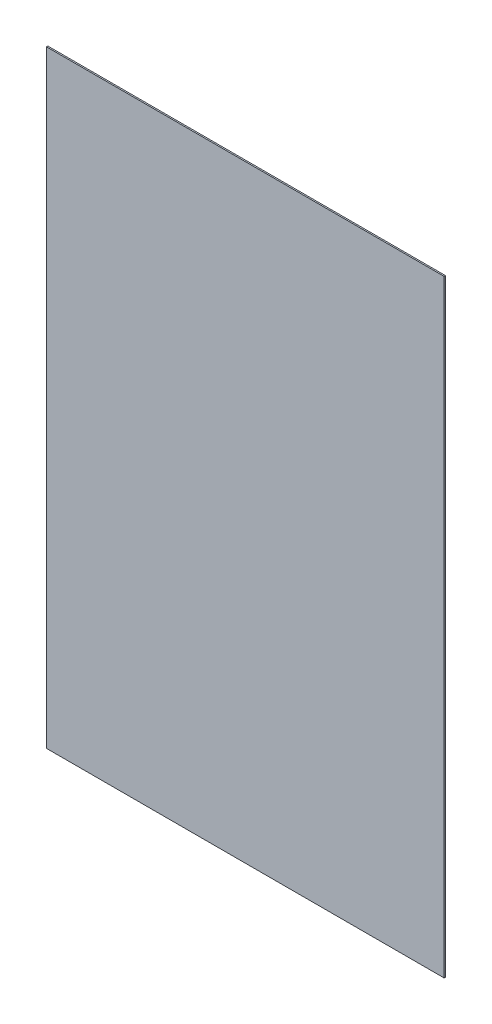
from build123d import *

# Parameters (mm, degrees)
SKETCH2_W           = 914.4
SKETCH2_H           = 1219.2
BOSS_EXTRUDE1_DEPTH = 1.5875
SKETCH3_W           = 914.4
SKETCH3_H           = 3.175
BOSS_EXTRUDE2_DEPTH = 177.8


with BuildPart() as part:
    # Sketch2 → Boss-Extrude1 (new, symmetric)
    with BuildSketch(Plane.XY):
        Rectangle(SKETCH2_W, SKETCH2_H)
    extrude(amount=BOSS_EXTRUDE1_DEPTH, both=True)

    # Sketch3 → Boss-Extrude2 (add)
    with BuildSketch(Plane.XZ.offset(609.6)):
        Rectangle(SKETCH3_W, SKETCH3_H)
    extrude(amount=BOSS_EXTRUDE2_DEPTH)


solid = part.part
